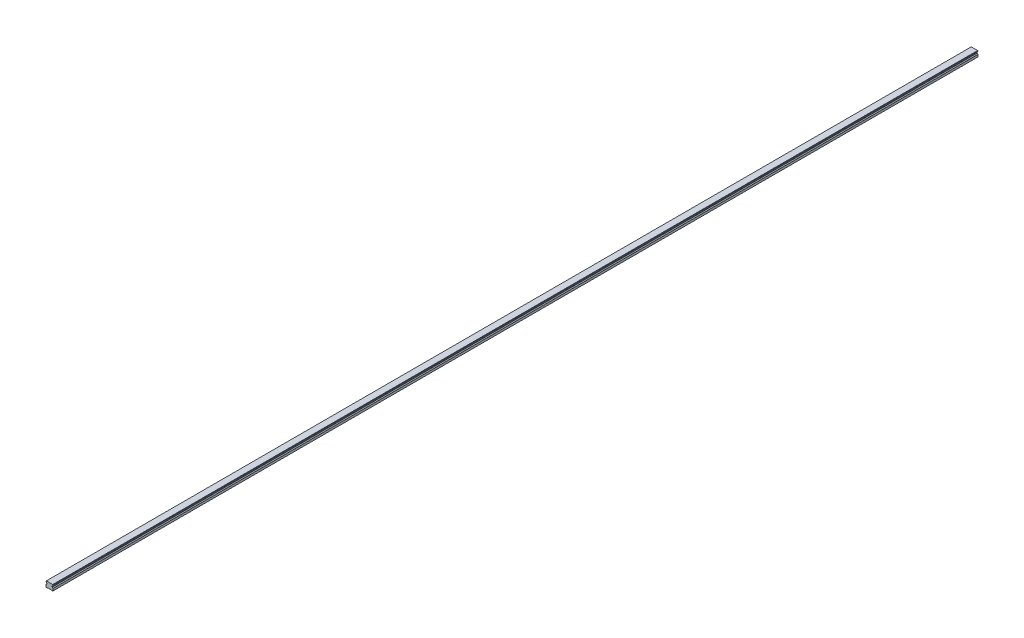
from build123d import *

# Parameters (mm, degrees)
SKETCH1_W           = 20
SKETCH1_H           = 16.3
BOSS_EXTRUDE1_DEPTH = 1310
CUT_EXTRUDE1_DEPTH  = 2621.069787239
CHAMFER1_SIZE       = 1
FILLET1_R           = 1
CUT_EXTRUDE2_DEPTH  = 2621.069787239
SKETCH5_R           = 3
SKETCH5_R_2         = 2.5
CUT_EXTRUDE5_DEPTH  = 10
SKETCH5_2_R         = 2.5
CUT_EXTRUDE6_DEPTH  = 13
LPATTERN2_COUNT     = 44
LPATTERN2_PITCH     = 60


with BuildPart() as part:
    # Sketch1 → Boss-Extrude1 (new, symmetric)
    with BuildSketch(Plane.XY):
        with Locations((0, 8.15)):
            Rectangle(SKETCH1_W, SKETCH1_H)
    extrude(amount=BOSS_EXTRUDE1_DEPTH, both=True)

    # Sketch2 → Cut-Extrude1 (cut, through all)
    with BuildSketch(Plane.XY.offset(1310)):
        Polygon((-10, 14.3), (-10, 7.3), (-7.666666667, 9.633333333), (-7.666666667, 11.966666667), align=None)
        Polygon((7.666666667, 11.966666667), (10, 14.3), (10, 7.3), (7.666666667, 9.633333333), align=None)
    extrude(amount=-CUT_EXTRUDE1_DEPTH, mode=Mode.SUBTRACT)

    # Chamfer1
    chamfer1_edges = [part.edges().sort_by_distance(p)[0] for p in [
        (-10, 16.3, 0),
        (10, 16.3, 0),
        (10, 0, 0),
        (-10, 0, 0),
    ]]
    chamfer(chamfer1_edges, length=CHAMFER1_SIZE)

    # Fillet1
    fillet1_edges = [part.edges().sort_by_distance(p)[0] for p in [
        (-7.666666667, 11.966666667, 0),
        (-7.666666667, 9.633333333, 0),
        (7.666666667, 9.633333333, 0),
        (7.666666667, 11.966666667, 0),
    ]]
    fillet(fillet1_edges, radius=FILLET1_R)

    # Sketch3 → Cut-Extrude2 (cut, through all)
    with BuildSketch(Plane.XY.offset(1310)):
        Polygon((-6, 0), (-5, 1), (5, 1), (6, 0), align=None)
    extrude(amount=-CUT_EXTRUDE2_DEPTH, mode=Mode.SUBTRACT)

    # Sketch5 → Cut-Extrude5 (cut)
    with BuildSketch(Plane.XZ.offset(-1)):
        with Locations(Location((0, 1290, 0), (0, 0, 270))):
            Circle(SKETCH5_R)
        with Locations(Location((0, 1290, 0), (0, 0, 270))):
            Circle(SKETCH5_R_2, mode=Mode.SUBTRACT)
    cut_extrude5 = extrude(amount=-CUT_EXTRUDE5_DEPTH, mode=Mode.SUBTRACT)

    # Sketch5_2 → Cut-Extrude6 (cut)
    with BuildSketch(Plane.XZ.offset(-1)):
        with Locations(Location((0, 1290, 0), (0, 0, 270))):
            Circle(SKETCH5_2_R)
    cut_extrude6 = extrude(amount=-CUT_EXTRUDE6_DEPTH, mode=Mode.SUBTRACT)

    # Cut-Extrude7 cone 1 section (on through the dimple's axis) → Cut-Extrude7 (revolve, cut)
    with BuildSketch(Plane(origin=(0, 14, 1290), x_dir=(0, 0, -1), z_dir=(1, 0, 0))):
        Polygon((0, 0), (2.5, 0), (0, 1.443375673), align=None)
    cut_extrude7 = revolve(axis=Axis((0, 14, 1290), (0, 1, 0)), mode=Mode.SUBTRACT)

    # LPattern2: Cut-Extrude5, Cut-Extrude6, Cut-Extrude7 ×44
    with Locations(*[(0, 0, -i * LPATTERN2_PITCH) for i in range(1, LPATTERN2_COUNT)]):
        add(cut_extrude5, mode=Mode.SUBTRACT)
        add(cut_extrude6, mode=Mode.SUBTRACT)
        add(cut_extrude7, mode=Mode.SUBTRACT)


solid = part.part
